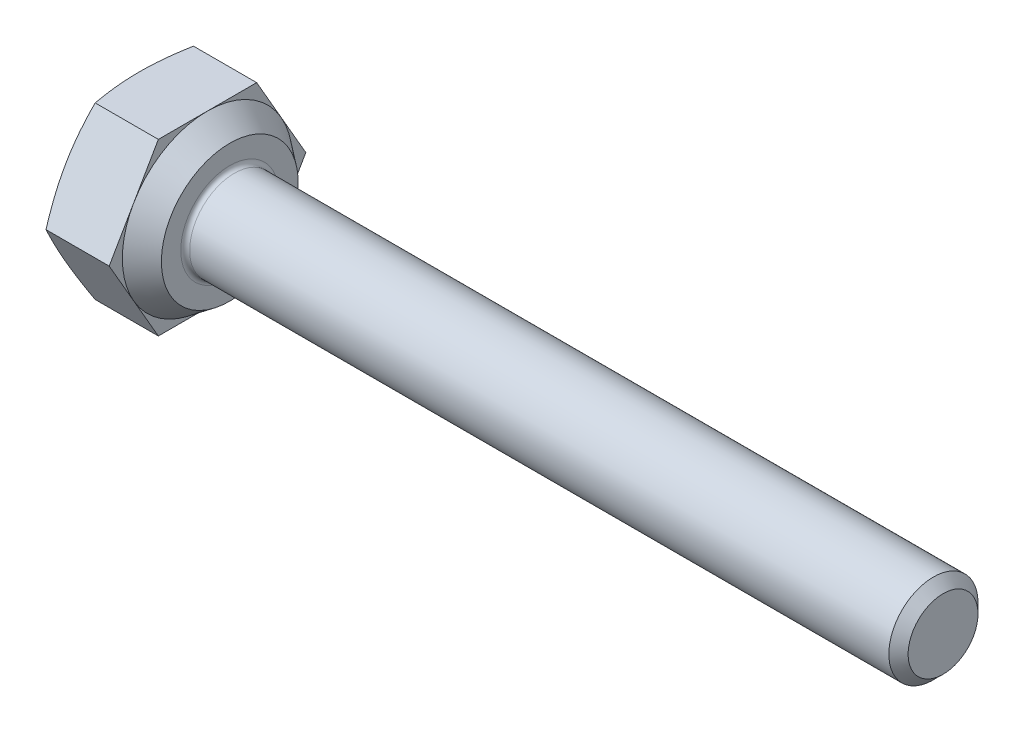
from build123d import *

# Parameters (mm, degrees)
BASEHEAD_DEPTH = 1.525
SKETCH3_R      = 1
BASEBODY_DEPTH = 16
HEADFILLET_R   = 0.1
CHAMFER1_SIZE  = 0.2165


with BuildPart() as part:
    # Sketch-BaseHead → BaseHead (new body)
    with BuildSketch(Plane(origin=(0, 0, 0), x_dir=(0, 0, -1), z_dir=(1, 0, 0))):
        Polygon((2.205478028, 0), (1.102739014, 1.91), (-1.102739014, 1.91), (-2.205478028, 0), (-1.102739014, -1.91), (1.102739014, -1.91), align=None)
    extrude(amount=BASEHEAD_DEPTH)

    # Sketch4 → HeadChamfer (revolve, cut)
    with BuildSketch(Plane(origin=(-0.264637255, 0, 5.916896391), x_dir=(0, 0, -1), z_dir=(0, 1, 0))):
        Polygon((8.122374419, -0.264637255), (7.826896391, -0.264637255), (8.122374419, -0.372182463), align=None)
    revolve(axis=Axis((-4.001564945, 0, 0), (1, 0, 0)), mode=Mode.SUBTRACT)

    # Sketch1 → Revolve1 (revolve)
    with BuildSketch(Plane.XY, mode=Mode.PRIVATE) as revolve1_sk:
        Polygon((1.525, 0), (2.025, 0), (2.025, -1.535), (1.525, -1.91), align=None)
    revolve(revolve1_sk.sketch.rotate(Axis((-4.001564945, 0, 0), (1, 0, 0)), 270), axis=Axis((-4.001564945, 0, 0), (1, 0, 0)))

    # Sketch3 → BaseBody (add)
    with BuildSketch(Plane(origin=(2.025, 0, 0), x_dir=(0, 0, -1), z_dir=(1, 0, 0))):
        Circle(SKETCH3_R)
    extrude(amount=BASEBODY_DEPTH)

    # HeadFillet
    headfillet_edges = [part.edges().sort_by_distance(p)[0] for p in [
        (2.025, 0, 1),
    ]]
    fillet(headfillet_edges, radius=HEADFILLET_R)

    # Chamfer1
    chamfer1_edges = [part.edges().sort_by_distance(p)[0] for p in [
        (18.025, 0, 1),
    ]]
    chamfer(chamfer1_edges, length=CHAMFER1_SIZE)


solid = part.part
